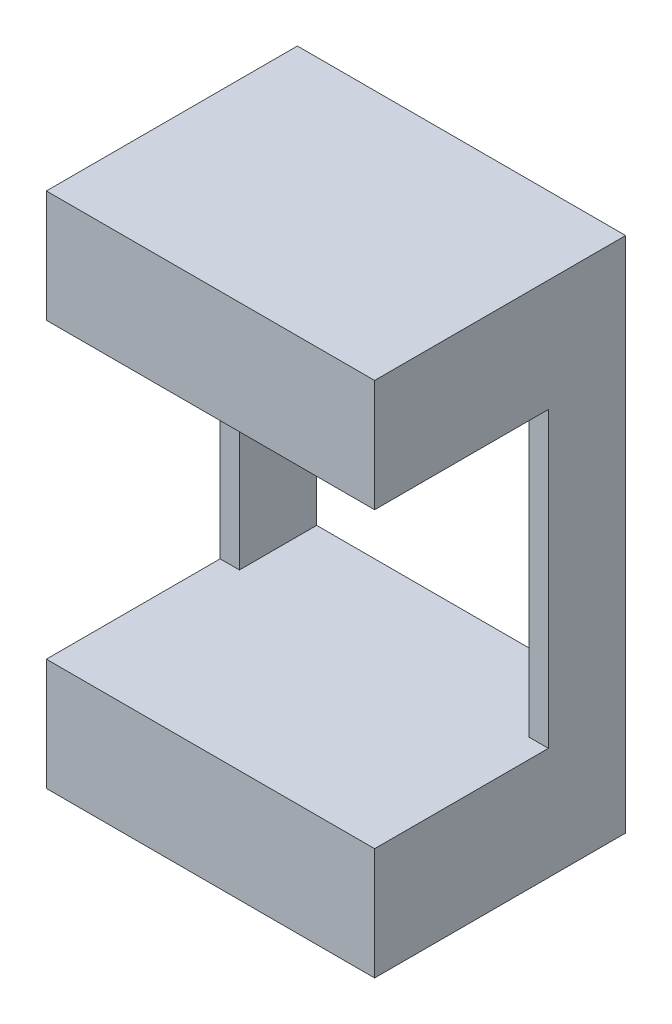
from build123d import *

# Parameters (mm, degrees)
SKETCH1_W           = 12.75
SKETCH1_H           = 28.5
SKETCH1_W_2         = 11.25
SKETCH1_H_2         = 19
BOSS_EXTRUDE1_DEPTH = 9
BOSS_EXTRUDE2_DEPTH = 9
CUT_EXTRUDE1_REACH  = 30.419
SKETCH3_W           = 6
SKETCH3_H           = 11.4
SKETCH5_W           = 12.75
SKETCH5_H           = 4.2
CUT_EXTRUDE2_DEPTH  = 8.6
SKETCH6_W           = 12.75
SKETCH6_H           = 4.2
CUT_EXTRUDE3_DEPTH  = 8.6
SKETCH9_W           = 12.75
SKETCH9_H           = 4.2
CUT_EXTRUDE6_DEPTH  = 10
SKETCH10_W          = 12.75
SKETCH10_H          = 4.35
BOSS_EXTRUDE3_DEPTH = 0.75


with BuildPart() as part:
    # Sketch1 → Boss-Extrude1 (new body)
    with BuildSketch(Plane.XY):
        with Locations((5.625, 9.5)):
            Rectangle(SKETCH1_W, SKETCH1_H)
        with Locations((5.625, 9.5)):
            Rectangle(SKETCH1_W_2, SKETCH1_H_2, mode=Mode.SUBTRACT)
    extrude(amount=BOSS_EXTRUDE1_DEPTH)

    # Sketch2 → Boss-Extrude2 (add)
    with BuildSketch(Plane.XY.offset(9)):
        with BuildLine():
            Line((4.125, 15.7), (0, 15.7))
            Line((0, 15.7), (0, 15.2))
            Line((0, 15.2), (11.25, 15.2))
            Line((11.25, 15.2), (11.25, 15.7))
            Line((11.25, 15.7), (7.125, 15.7))
            Line((7.125, 15.7), (7.125, 16.2))
            ThreePointArc((7.125, 16.2), (5.625, 17.7), (4.125, 16.2))
            Line((4.125, 16.2), (4.125, 15.7))
        make_face()
        with BuildLine():
            Line((0, 3.8), (0, 3.3))
            Line((0, 3.3), (4.125, 3.3))
            Line((4.125, 3.3), (4.125, 2.8))
            ThreePointArc((4.125, 2.8), (5.625, 1.3), (7.125, 2.8))
            Line((7.125, 2.8), (7.125, 3.3))
            Line((7.125, 3.3), (11.25, 3.3))
            Line((11.25, 3.3), (11.25, 3.8))
            Line((11.25, 3.8), (0, 3.8))
        make_face()
    extrude(amount=-BOSS_EXTRUDE2_DEPTH)

    # Cut-Extrude1: up to this face of the body (flat: up to its plane)
    cut_extrude1_end = Plane(part.part.faces().sort_by_distance((12, 9.5, 4.5))[0])
    # Sketch3 → Cut-Extrude1 (cut, up to the picked face)
    with BuildSketch(Plane.ZY.offset(0.75), mode=Mode.PRIVATE) as cut_extrude1_sk1:
        with Locations((6, 9.5)):
            Rectangle(SKETCH3_W, SKETCH3_H)
    cut_extrude1_tool1 = split(extrude(cut_extrude1_sk1.sketch, amount=-CUT_EXTRUDE1_REACH, mode=Mode.PRIVATE), bisect_by=cut_extrude1_end, keep=Keep.BOTH, mode=Mode.PRIVATE)
    add(cut_extrude1_tool1.solids().sort_by(Axis((-0.75, 9.5, 6), (1, 0, 0)))[0], mode=Mode.SUBTRACT)

    # Sketch5 → Cut-Extrude2 (cut)
    with BuildSketch(Plane.XY.offset(9)):
        with Locations((5.625, -2.65)):
            Rectangle(SKETCH5_W, SKETCH5_H)
    extrude(amount=-CUT_EXTRUDE2_DEPTH, mode=Mode.SUBTRACT)

    # Sketch6 → Cut-Extrude3 (cut)
    with BuildSketch(Plane.XY.offset(9)):
        with Locations((5.625, 21.65)):
            Rectangle(SKETCH6_W, SKETCH6_H)
    extrude(amount=-CUT_EXTRUDE3_DEPTH, mode=Mode.SUBTRACT)

    # Sketch9 → Cut-Extrude6 (cut)
    with BuildSketch(Plane(origin=(0, 0, 0), x_dir=(-1, 0, 0), z_dir=(0, 0, -1))):
        with Locations((-5.625, 21.65)):
            Rectangle(SKETCH9_W, SKETCH9_H)
        with Locations((-5.625, -2.65)):
            Rectangle(SKETCH9_W, SKETCH9_H)
    extrude(amount=-CUT_EXTRUDE6_DEPTH, mode=Mode.SUBTRACT)

    # Sketch10 → Boss-Extrude3 (add)
    with BuildSketch(Plane.XY.offset(9)):
        with Locations((5.625, 17.375)):
            Rectangle(SKETCH10_W, SKETCH10_H)
        with Locations((5.625, 1.625)):
            Rectangle(SKETCH10_W, SKETCH10_H)
    extrude(amount=BOSS_EXTRUDE3_DEPTH)


solid = part.part
